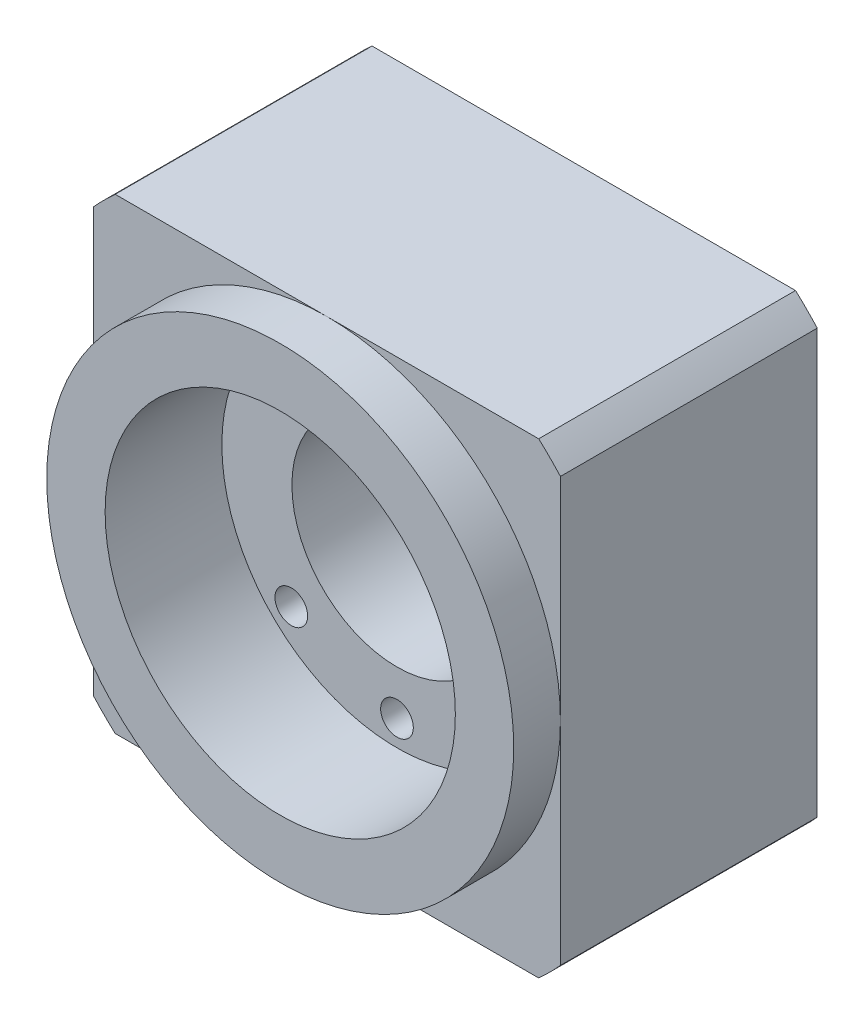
ISO-10303-21;
HEADER;
FILE_DESCRIPTION(('STEP AP214'),'2;1');
FILE_NAME('part.step','',(''),(''),'','','');
FILE_SCHEMA(('AUTOMOTIVE_DESIGN { 1 0 10303 214 1 1 1 1 }'));
ENDSEC;
DATA;
#1=APPLICATION_CONTEXT('core data for automotive mechanical design processes');
#2=APPLICATION_PROTOCOL_DEFINITION('international standard','automotive_design',2000,#1);
#3=PRODUCT_CONTEXT('',#1,'mechanical');
#4=PRODUCT('Part','Part','',(#3));
#5=PRODUCT_RELATED_PRODUCT_CATEGORY('part','',(#4));
#6=PRODUCT_DEFINITION_FORMATION('','',#4);
#7=PRODUCT_DEFINITION_CONTEXT('part definition',#1,'design');
#8=PRODUCT_DEFINITION('design','',#6,#7);
#9=PRODUCT_DEFINITION_SHAPE('','',#8);
#10=(LENGTH_UNIT() NAMED_UNIT(*) SI_UNIT(.MILLI.,.METRE.));
#11=(NAMED_UNIT(*) PLANE_ANGLE_UNIT() SI_UNIT($,.RADIAN.));
#12=(NAMED_UNIT(*) SI_UNIT($,.STERADIAN.) SOLID_ANGLE_UNIT());
#13=UNCERTAINTY_MEASURE_WITH_UNIT(LENGTH_MEASURE(1.E-05),#10,'distance_accuracy_value','');
#14=(GEOMETRIC_REPRESENTATION_CONTEXT(3) GLOBAL_UNCERTAINTY_ASSIGNED_CONTEXT((#13)) GLOBAL_UNIT_ASSIGNED_CONTEXT((#10,
#11,#12)) REPRESENTATION_CONTEXT('',''));
#15=CARTESIAN_POINT('',(0.,0.,0.));
#16=DIRECTION('',(0.,0.,1.));
#17=DIRECTION('',(1.,0.,0.));
#18=AXIS2_PLACEMENT_3D('',#15,#16,#17);
#19=CARTESIAN_POINT('',(22.0159155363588,21.5517258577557,40.));
#20=DIRECTION('',(0.,0.,-1.));
#21=DIRECTION('',(-1.,0.,0.));
#22=AXIS2_PLACEMENT_3D('',#19,#20,#21);
#23=PLANE('',#22);
#24=CARTESIAN_POINT('',(22.0159155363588,21.5517258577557,40.));
#25=DIRECTION('',(0.,0.,-1.));
#26=DIRECTION('',(-1.,0.,0.));
#27=AXIS2_PLACEMENT_3D('',#24,#25,#26);
#28=CIRCLE('',#27,22.5);
#29=CARTESIAN_POINT('',(-0.484084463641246,21.5517258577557,40.));
#30=VERTEX_POINT('',#29);
#31=EDGE_CURVE('E176',#30,#30,#28,.T.);
#32=ORIENTED_EDGE('',*,*,#31,.T.);
#33=EDGE_LOOP('',(#32));
#34=FACE_BOUND('',#33,.T.);
#35=CARTESIAN_POINT('',(22.0159155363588,-10.4482741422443,40.));
#36=DIRECTION('',(0.,0.,1.));
#37=DIRECTION('',(1.,0.,0.));
#38=AXIS2_PLACEMENT_3D('',#35,#36,#37);
#39=CIRCLE('',#38,3.5);
#40=CARTESIAN_POINT('',(25.5159155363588,-10.4482741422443,40.));
#41=VERTEX_POINT('',#40);
#42=EDGE_CURVE('E179',#41,#41,#39,.F.);
#43=ORIENTED_EDGE('',*,*,#42,.T.);
#44=EDGE_LOOP('',(#43));
#45=FACE_BOUND('',#44,.T.);
#46=CARTESIAN_POINT('',(44.6433325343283,-1.07569114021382,40.));
#47=DIRECTION('',(0.,0.,1.));
#48=DIRECTION('',(1.,0.,0.));
#49=AXIS2_PLACEMENT_3D('',#46,#47,#48);
#50=CIRCLE('',#49,3.50000000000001);
#51=CARTESIAN_POINT('',(48.1433325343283,-1.07569114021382,40.));
#52=VERTEX_POINT('',#51);
#53=EDGE_CURVE('E182',#52,#52,#50,.F.);
#54=ORIENTED_EDGE('',*,*,#53,.T.);
#55=EDGE_LOOP('',(#54));
#56=FACE_BOUND('',#55,.T.);
#57=CARTESIAN_POINT('',(-0.611501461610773,-1.07569114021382,40.));
#58=DIRECTION('',(0.,0.,1.));
#59=DIRECTION('',(1.,0.,0.));
#60=AXIS2_PLACEMENT_3D('',#57,#58,#59);
#61=CIRCLE('',#60,3.5);
#62=CARTESIAN_POINT('',(2.88849853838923,-1.07569114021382,40.));
#63=VERTEX_POINT('',#62);
#64=EDGE_CURVE('E185',#63,#63,#61,.F.);
#65=ORIENTED_EDGE('',*,*,#64,.T.);
#66=EDGE_LOOP('',(#65));
#67=FACE_BOUND('',#66,.T.);
#68=CARTESIAN_POINT('',(22.0159155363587,53.5517258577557,40.));
#69=DIRECTION('',(0.,0.,1.));
#70=DIRECTION('',(1.,0.,0.));
#71=AXIS2_PLACEMENT_3D('',#68,#69,#70);
#72=CIRCLE('',#71,3.5);
#73=CARTESIAN_POINT('',(25.5159155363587,53.5517258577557,40.));
#74=VERTEX_POINT('',#73);
#75=EDGE_CURVE('E188',#74,#74,#72,.F.);
#76=ORIENTED_EDGE('',*,*,#75,.T.);
#77=EDGE_LOOP('',(#76));
#78=FACE_BOUND('',#77,.T.);
#79=CARTESIAN_POINT('',(44.6433325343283,44.1791428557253,40.));
#80=DIRECTION('',(0.,0.,1.));
#81=DIRECTION('',(1.,0.,0.));
#82=AXIS2_PLACEMENT_3D('',#79,#80,#81);
#83=CIRCLE('',#82,3.5);
#84=CARTESIAN_POINT('',(48.1433325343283,44.1791428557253,40.));
#85=VERTEX_POINT('',#84);
#86=EDGE_CURVE('E191',#85,#85,#83,.F.);
#87=ORIENTED_EDGE('',*,*,#86,.T.);
#88=EDGE_LOOP('',(#87));
#89=FACE_BOUND('',#88,.T.);
#90=CARTESIAN_POINT('',(-0.611501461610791,44.1791428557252,40.));
#91=DIRECTION('',(0.,0.,1.));
#92=DIRECTION('',(1.,0.,0.));
#93=AXIS2_PLACEMENT_3D('',#90,#91,#92);
#94=CIRCLE('',#93,3.5);
#95=CARTESIAN_POINT('',(2.88849853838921,44.1791428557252,40.));
#96=VERTEX_POINT('',#95);
#97=EDGE_CURVE('E193',#96,#96,#94,.F.);
#98=ORIENTED_EDGE('',*,*,#97,.T.);
#99=EDGE_LOOP('',(#98));
#100=FACE_BOUND('',#99,.T.);
#101=CARTESIAN_POINT('',(22.0159155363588,21.5517258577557,40.));
#102=DIRECTION('',(0.,0.,-1.));
#103=DIRECTION('',(-1.,0.,0.));
#104=AXIS2_PLACEMENT_3D('',#101,#102,#103);
#105=CIRCLE('',#104,37.5);
#106=CARTESIAN_POINT('',(-15.4840844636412,21.5517258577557,40.));
#107=VERTEX_POINT('',#106);
#108=EDGE_CURVE('E20',#107,#107,#105,.F.);
#109=ORIENTED_EDGE('',*,*,#108,.T.);
#110=EDGE_LOOP('',(#109));
#111=FACE_BOUND('',#110,.T.);
#112=ADVANCED_FACE('F16',(#34,#45,#56,#67,#78,#89,#100,#111),#23,.F.);
#113=CARTESIAN_POINT('',(22.0159155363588,21.5517258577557,65.));
#114=DIRECTION('',(0.,0.,-1.));
#115=DIRECTION('',(-1.,0.,0.));
#116=AXIS2_PLACEMENT_3D('',#113,#114,#115);
#117=CYLINDRICAL_SURFACE('',#116,37.5);
#118=CARTESIAN_POINT('',(22.0159155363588,21.5517258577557,65.));
#119=DIRECTION('',(0.,0.,-1.));
#120=DIRECTION('',(-1.,0.,0.));
#121=AXIS2_PLACEMENT_3D('',#118,#119,#120);
#122=CIRCLE('',#121,37.5);
#123=CARTESIAN_POINT('',(-15.4840844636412,21.5517258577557,65.));
#124=VERTEX_POINT('',#123);
#125=EDGE_CURVE('E103',#124,#124,#122,.F.);
#126=ORIENTED_EDGE('',*,*,#125,.T.);
#127=EDGE_LOOP('',(#126));
#128=FACE_BOUND('',#127,.T.);
#129=ORIENTED_EDGE('',*,*,#108,.F.);
#130=EDGE_LOOP('',(#129));
#131=FACE_BOUND('',#130,.T.);
#132=ADVANCED_FACE('F201',(#128,#131),#117,.F.);
#133=CARTESIAN_POINT('',(-0.611501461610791,44.1791428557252,170.643824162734));
#134=DIRECTION('',(0.,0.,1.));
#135=DIRECTION('',(1.,0.,0.));
#136=AXIS2_PLACEMENT_3D('',#133,#134,#135);
#137=CYLINDRICAL_SURFACE('',#136,3.5);
#138=ORIENTED_EDGE('',*,*,#97,.F.);
#139=EDGE_LOOP('',(#138));
#140=FACE_BOUND('',#139,.T.);
#141=CARTESIAN_POINT('',(-0.611501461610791,44.1791428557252,15.));
#142=DIRECTION('',(0.,0.,1.));
#143=DIRECTION('',(1.,0.,0.));
#144=AXIS2_PLACEMENT_3D('',#141,#142,#143);
#145=CIRCLE('',#144,3.5);
#146=CARTESIAN_POINT('',(2.88849853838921,44.1791428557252,15.));
#147=VERTEX_POINT('',#146);
#148=EDGE_CURVE('E102',#147,#147,#145,.F.);
#149=ORIENTED_EDGE('',*,*,#148,.T.);
#150=EDGE_LOOP('',(#149));
#151=FACE_BOUND('',#150,.T.);
#152=ADVANCED_FACE('F203',(#140,#151),#137,.F.);
#153=CARTESIAN_POINT('',(44.6433325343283,44.1791428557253,170.643824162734));
#154=DIRECTION('',(0.,0.,1.));
#155=DIRECTION('',(1.,0.,0.));
#156=AXIS2_PLACEMENT_3D('',#153,#154,#155);
#157=CYLINDRICAL_SURFACE('',#156,3.5);
#158=ORIENTED_EDGE('',*,*,#86,.F.);
#159=EDGE_LOOP('',(#158));
#160=FACE_BOUND('',#159,.T.);
#161=CARTESIAN_POINT('',(44.6433325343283,44.1791428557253,15.));
#162=DIRECTION('',(0.,0.,1.));
#163=DIRECTION('',(1.,0.,0.));
#164=AXIS2_PLACEMENT_3D('',#161,#162,#163);
#165=CIRCLE('',#164,3.5);
#166=CARTESIAN_POINT('',(48.1433325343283,44.1791428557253,15.));
#167=VERTEX_POINT('',#166);
#168=EDGE_CURVE('E169',#167,#167,#165,.F.);
#169=ORIENTED_EDGE('',*,*,#168,.T.);
#170=EDGE_LOOP('',(#169));
#171=FACE_BOUND('',#170,.T.);
#172=ADVANCED_FACE('F209',(#160,#171),#157,.F.);
#173=CARTESIAN_POINT('',(22.0159155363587,53.5517258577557,170.643824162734));
#174=DIRECTION('',(0.,0.,1.));
#175=DIRECTION('',(1.,0.,0.));
#176=AXIS2_PLACEMENT_3D('',#173,#174,#175);
#177=CYLINDRICAL_SURFACE('',#176,3.5);
#178=ORIENTED_EDGE('',*,*,#75,.F.);
#179=EDGE_LOOP('',(#178));
#180=FACE_BOUND('',#179,.T.);
#181=CARTESIAN_POINT('',(22.0159155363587,53.5517258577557,15.));
#182=DIRECTION('',(0.,0.,1.));
#183=DIRECTION('',(1.,0.,0.));
#184=AXIS2_PLACEMENT_3D('',#181,#182,#183);
#185=CIRCLE('',#184,3.5);
#186=CARTESIAN_POINT('',(25.5159155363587,53.5517258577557,15.));
#187=VERTEX_POINT('',#186);
#188=EDGE_CURVE('E166',#187,#187,#185,.F.);
#189=ORIENTED_EDGE('',*,*,#188,.T.);
#190=EDGE_LOOP('',(#189));
#191=FACE_BOUND('',#190,.T.);
#192=ADVANCED_FACE('F231',(#180,#191),#177,.F.);
#193=CARTESIAN_POINT('',(-0.611501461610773,-1.07569114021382,15.));
#194=DIRECTION('',(0.,0.,1.));
#195=DIRECTION('',(1.,0.,0.));
#196=AXIS2_PLACEMENT_3D('',#193,#194,#195);
#197=CYLINDRICAL_SURFACE('',#196,3.5);
#198=ORIENTED_EDGE('',*,*,#64,.F.);
#199=EDGE_LOOP('',(#198));
#200=FACE_BOUND('',#199,.T.);
#201=CARTESIAN_POINT('',(-0.611501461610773,-1.07569114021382,15.));
#202=DIRECTION('',(0.,0.,1.));
#203=DIRECTION('',(1.,0.,0.));
#204=AXIS2_PLACEMENT_3D('',#201,#202,#203);
#205=CIRCLE('',#204,3.5);
#206=CARTESIAN_POINT('',(2.88849853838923,-1.07569114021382,15.));
#207=VERTEX_POINT('',#206);
#208=EDGE_CURVE('E163',#207,#207,#205,.F.);
#209=ORIENTED_EDGE('',*,*,#208,.T.);
#210=EDGE_LOOP('',(#209));
#211=FACE_BOUND('',#210,.T.);
#212=ADVANCED_FACE('F228',(#200,#211),#197,.F.);
#213=CARTESIAN_POINT('',(44.6433325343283,-1.07569114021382,15.));
#214=DIRECTION('',(0.,0.,1.));
#215=DIRECTION('',(1.,0.,0.));
#216=AXIS2_PLACEMENT_3D('',#213,#214,#215);
#217=CYLINDRICAL_SURFACE('',#216,3.50000000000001);
#218=ORIENTED_EDGE('',*,*,#53,.F.);
#219=EDGE_LOOP('',(#218));
#220=FACE_BOUND('',#219,.T.);
#221=CARTESIAN_POINT('',(44.6433325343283,-1.07569114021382,15.));
#222=DIRECTION('',(0.,0.,1.));
#223=DIRECTION('',(1.,0.,0.));
#224=AXIS2_PLACEMENT_3D('',#221,#222,#223);
#225=CIRCLE('',#224,3.50000000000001);
#226=CARTESIAN_POINT('',(48.1433325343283,-1.07569114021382,15.));
#227=VERTEX_POINT('',#226);
#228=EDGE_CURVE('E160',#227,#227,#225,.F.);
#229=ORIENTED_EDGE('',*,*,#228,.T.);
#230=EDGE_LOOP('',(#229));
#231=FACE_BOUND('',#230,.T.);
#232=ADVANCED_FACE('F230',(#220,#231),#217,.F.);
#233=CARTESIAN_POINT('',(22.0159155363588,-10.4482741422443,15.));
#234=DIRECTION('',(0.,0.,1.));
#235=DIRECTION('',(1.,0.,0.));
#236=AXIS2_PLACEMENT_3D('',#233,#234,#235);
#237=CYLINDRICAL_SURFACE('',#236,3.5);
#238=ORIENTED_EDGE('',*,*,#42,.F.);
#239=EDGE_LOOP('',(#238));
#240=FACE_BOUND('',#239,.T.);
#241=CARTESIAN_POINT('',(22.0159155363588,-10.4482741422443,15.));
#242=DIRECTION('',(0.,0.,1.));
#243=DIRECTION('',(1.,0.,0.));
#244=AXIS2_PLACEMENT_3D('',#241,#242,#243);
#245=CIRCLE('',#244,3.5);
#246=CARTESIAN_POINT('',(25.5159155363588,-10.4482741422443,15.));
#247=VERTEX_POINT('',#246);
#248=EDGE_CURVE('E157',#247,#247,#245,.F.);
#249=ORIENTED_EDGE('',*,*,#248,.T.);
#250=EDGE_LOOP('',(#249));
#251=FACE_BOUND('',#250,.T.);
#252=ADVANCED_FACE('F18',(#240,#251),#237,.F.);
#253=CARTESIAN_POINT('',(22.0159155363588,21.5517258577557,40.));
#254=DIRECTION('',(0.,0.,-1.));
#255=DIRECTION('',(-1.,0.,0.));
#256=AXIS2_PLACEMENT_3D('',#253,#254,#255);
#257=CYLINDRICAL_SURFACE('',#256,22.5);
#258=CARTESIAN_POINT('',(22.0159155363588,21.5517258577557,15.));
#259=DIRECTION('',(0.,0.,-1.));
#260=DIRECTION('',(-1.,0.,0.));
#261=AXIS2_PLACEMENT_3D('',#258,#259,#260);
#262=CIRCLE('',#261,22.5);
#263=CARTESIAN_POINT('',(-0.484084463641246,21.5517258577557,15.));
#264=VERTEX_POINT('',#263);
#265=EDGE_CURVE('E154',#264,#264,#262,.T.);
#266=ORIENTED_EDGE('',*,*,#265,.T.);
#267=EDGE_LOOP('',(#266));
#268=FACE_BOUND('',#267,.T.);
#269=ORIENTED_EDGE('',*,*,#31,.F.);
#270=EDGE_LOOP('',(#269));
#271=FACE_BOUND('',#270,.T.);
#272=ADVANCED_FACE('F237',(#268,#271),#257,.F.);
#273=CARTESIAN_POINT('',(22.0159155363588,21.5517258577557,65.));
#274=DIRECTION('',(0.,0.,-1.));
#275=DIRECTION('',(-1.,0.,0.));
#276=AXIS2_PLACEMENT_3D('',#273,#274,#275);
#277=PLANE('',#276);
#278=ORIENTED_EDGE('',*,*,#125,.F.);
#279=EDGE_LOOP('',(#278));
#280=FACE_BOUND('',#279,.T.);
#281=CARTESIAN_POINT('',(22.0159155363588,21.5517258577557,65.));
#282=DIRECTION('',(0.,0.,1.));
#283=DIRECTION('',(1.,0.,0.));
#284=AXIS2_PLACEMENT_3D('',#281,#282,#283);
#285=CIRCLE('',#284,50.);
#286=CARTESIAN_POINT('',(72.0159155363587,21.5517258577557,65.));
#287=VERTEX_POINT('',#286);
#288=EDGE_CURVE('E114',#287,#287,#285,.F.);
#289=ORIENTED_EDGE('',*,*,#288,.F.);
#290=EDGE_LOOP('',(#289));
#291=FACE_BOUND('',#290,.T.);
#292=ADVANCED_FACE('F360',(#280,#291),#277,.F.);
#293=CARTESIAN_POINT('',(22.0159155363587,21.5517258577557,55.));
#294=DIRECTION('',(0.,0.,1.));
#295=DIRECTION('',(1.,0.,0.));
#296=AXIS2_PLACEMENT_3D('',#293,#294,#295);
#297=PLANE('',#296);
#298=CARTESIAN_POINT('',(22.0159155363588,21.5517258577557,55.));
#299=DIRECTION('',(0.,0.,1.));
#300=DIRECTION('',(1.,0.,0.));
#301=AXIS2_PLACEMENT_3D('',#298,#299,#300);
#302=CIRCLE('',#301,67.5);
#303=CARTESIAN_POINT('',(-27.9840844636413,66.8976187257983,55.));
#304=VERTEX_POINT('',#303);
#305=CARTESIAN_POINT('',(-23.3299773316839,71.5517258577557,55.));
#306=VERTEX_POINT('',#305);
#307=EDGE_CURVE('E110',#304,#306,#302,.F.);
#308=ORIENTED_EDGE('',*,*,#307,.F.);
#309=DIRECTION('',(0.,1.,0.));
#310=VECTOR('',#309,1.);
#311=CARTESIAN_POINT('',(-27.9840844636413,-23.7941670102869,55.));
#312=LINE('',#311,#310);
#313=CARTESIAN_POINT('',(-27.9840844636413,21.5517258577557,55.));
#314=VERTEX_POINT('',#313);
#315=EDGE_CURVE('E106',#314,#304,#312,.T.);
#316=ORIENTED_EDGE('',*,*,#315,.F.);
#317=CARTESIAN_POINT('',(22.0159155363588,21.5517258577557,55.));
#318=DIRECTION('',(0.,0.,1.));
#319=DIRECTION('',(1.,0.,0.));
#320=AXIS2_PLACEMENT_3D('',#317,#318,#319);
#321=CIRCLE('',#320,50.);
#322=CARTESIAN_POINT('',(22.0159155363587,71.5517258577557,55.));
#323=VERTEX_POINT('',#322);
#324=EDGE_CURVE('E91',#314,#323,#321,.F.);
#325=ORIENTED_EDGE('',*,*,#324,.T.);
#326=DIRECTION('',(1.,0.,0.));
#327=VECTOR('',#326,1.);
#328=CARTESIAN_POINT('',(-23.3299773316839,71.5517258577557,55.));
#329=LINE('',#328,#327);
#330=EDGE_CURVE('E150',#306,#323,#329,.T.);
#331=ORIENTED_EDGE('',*,*,#330,.F.);
#332=EDGE_LOOP('',(#308,#316,#325,#331));
#333=FACE_BOUND('',#332,.T.);
#334=ADVANCED_FACE('F108',(#333),#297,.T.);
#335=CARTESIAN_POINT('',(22.0159155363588,21.5517258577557,15.));
#336=DIRECTION('',(0.,0.,1.));
#337=DIRECTION('',(1.,0.,0.));
#338=AXIS2_PLACEMENT_3D('',#335,#336,#337);
#339=PLANE('',#338);
#340=ORIENTED_EDGE('',*,*,#265,.F.);
#341=EDGE_LOOP('',(#340));
#342=FACE_BOUND('',#341,.T.);
#343=ORIENTED_EDGE('',*,*,#248,.F.);
#344=EDGE_LOOP('',(#343));
#345=FACE_BOUND('',#344,.T.);
#346=ORIENTED_EDGE('',*,*,#228,.F.);
#347=EDGE_LOOP('',(#346));
#348=FACE_BOUND('',#347,.T.);
#349=ORIENTED_EDGE('',*,*,#208,.F.);
#350=EDGE_LOOP('',(#349));
#351=FACE_BOUND('',#350,.T.);
#352=ORIENTED_EDGE('',*,*,#188,.F.);
#353=EDGE_LOOP('',(#352));
#354=FACE_BOUND('',#353,.T.);
#355=ORIENTED_EDGE('',*,*,#168,.F.);
#356=EDGE_LOOP('',(#355));
#357=FACE_BOUND('',#356,.T.);
#358=ORIENTED_EDGE('',*,*,#148,.F.);
#359=EDGE_LOOP('',(#358));
#360=FACE_BOUND('',#359,.T.);
#361=CARTESIAN_POINT('',(22.0159155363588,21.5517258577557,15.));
#362=DIRECTION('',(0.,0.,1.));
#363=DIRECTION('',(1.,0.,0.));
#364=AXIS2_PLACEMENT_3D('',#361,#362,#363);
#365=CIRCLE('',#364,45.);
#366=CARTESIAN_POINT('',(67.0159155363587,21.5517258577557,15.));
#367=VERTEX_POINT('',#366);
#368=EDGE_CURVE('E140',#367,#367,#365,.F.);
#369=ORIENTED_EDGE('',*,*,#368,.T.);
#370=EDGE_LOOP('',(#369));
#371=FACE_BOUND('',#370,.T.);
#372=ADVANCED_FACE('F243',(#342,#345,#348,#351,#354,#357,#360,#371),#339,.F.);
#373=CARTESIAN_POINT('',(22.0159155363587,21.5517258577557,55.));
#374=DIRECTION('',(0.,0.,1.));
#375=DIRECTION('',(1.,0.,0.));
#376=AXIS2_PLACEMENT_3D('',#373,#374,#375);
#377=PLANE('',#376);
#378=CARTESIAN_POINT('',(22.0159155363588,21.5517258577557,55.));
#379=DIRECTION('',(0.,0.,1.));
#380=DIRECTION('',(1.,0.,0.));
#381=AXIS2_PLACEMENT_3D('',#378,#379,#380);
#382=CIRCLE('',#381,67.5);
#383=CARTESIAN_POINT('',(67.3618084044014,71.5517258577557,55.));
#384=VERTEX_POINT('',#383);
#385=CARTESIAN_POINT('',(72.0159155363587,66.8976187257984,55.));
#386=VERTEX_POINT('',#385);
#387=EDGE_CURVE('E113',#384,#386,#382,.F.);
#388=ORIENTED_EDGE('',*,*,#387,.F.);
#389=DIRECTION('',(1.,0.,0.));
#390=VECTOR('',#389,1.);
#391=CARTESIAN_POINT('',(-23.3299773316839,71.5517258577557,55.));
#392=LINE('',#391,#390);
#393=EDGE_CURVE('E326',#323,#384,#392,.T.);
#394=ORIENTED_EDGE('',*,*,#393,.F.);
#395=CARTESIAN_POINT('',(22.0159155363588,21.5517258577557,55.));
#396=DIRECTION('',(0.,0.,1.));
#397=DIRECTION('',(1.,0.,0.));
#398=AXIS2_PLACEMENT_3D('',#395,#396,#397);
#399=CIRCLE('',#398,50.);
#400=CARTESIAN_POINT('',(72.0159155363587,21.5517258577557,55.));
#401=VERTEX_POINT('',#400);
#402=EDGE_CURVE('E99',#323,#401,#399,.F.);
#403=ORIENTED_EDGE('',*,*,#402,.T.);
#404=DIRECTION('',(0.,1.,0.));
#405=VECTOR('',#404,1.);
#406=CARTESIAN_POINT('',(72.0159155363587,66.8976187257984,55.));
#407=LINE('',#406,#405);
#408=EDGE_CURVE('E143',#386,#401,#407,.F.);
#409=ORIENTED_EDGE('',*,*,#408,.F.);
#410=EDGE_LOOP('',(#388,#394,#403,#409));
#411=FACE_BOUND('',#410,.T.);
#412=ADVANCED_FACE('F246',(#411),#377,.T.);
#413=CARTESIAN_POINT('',(22.0159155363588,21.5517258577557,55.));
#414=DIRECTION('',(0.,0.,1.));
#415=DIRECTION('',(1.,0.,0.));
#416=AXIS2_PLACEMENT_3D('',#413,#414,#415);
#417=CYLINDRICAL_SURFACE('',#416,50.);
#418=ORIENTED_EDGE('',*,*,#324,.F.);
#419=CARTESIAN_POINT('',(22.0159155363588,21.5517258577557,55.));
#420=DIRECTION('',(0.,0.,1.));
#421=DIRECTION('',(1.,0.,0.));
#422=AXIS2_PLACEMENT_3D('',#419,#420,#421);
#423=CIRCLE('',#422,50.);
#424=CARTESIAN_POINT('',(22.0159155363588,-28.4482741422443,55.));
#425=VERTEX_POINT('',#424);
#426=EDGE_CURVE('E97',#425,#314,#423,.F.);
#427=ORIENTED_EDGE('',*,*,#426,.F.);
#428=CARTESIAN_POINT('',(22.0159155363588,21.5517258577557,55.));
#429=DIRECTION('',(0.,0.,1.));
#430=DIRECTION('',(1.,0.,0.));
#431=AXIS2_PLACEMENT_3D('',#428,#429,#430);
#432=CIRCLE('',#431,50.);
#433=EDGE_CURVE('E133',#401,#425,#432,.F.);
#434=ORIENTED_EDGE('',*,*,#433,.F.);
#435=ORIENTED_EDGE('',*,*,#402,.F.);
#436=EDGE_LOOP('',(#418,#427,#434,#435));
#437=FACE_BOUND('',#436,.T.);
#438=ORIENTED_EDGE('',*,*,#288,.T.);
#439=EDGE_LOOP('',(#438));
#440=FACE_BOUND('',#439,.T.);
#441=ADVANCED_FACE('F93',(#437,#440),#417,.T.);
#442=CARTESIAN_POINT('',(-27.9840844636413,-23.7941670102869,0.));
#443=DIRECTION('',(-1.,0.,0.));
#444=DIRECTION('',(0.,0.,1.));
#445=AXIS2_PLACEMENT_3D('',#442,#443,#444);
#446=PLANE('',#445);
#447=DIRECTION('',(0.,1.,0.));
#448=VECTOR('',#447,1.);
#449=CARTESIAN_POINT('',(-27.9840844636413,21.5517258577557,0.));
#450=LINE('',#449,#448);
#451=CARTESIAN_POINT('',(-27.9840844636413,66.8976187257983,0.));
#452=VERTEX_POINT('',#451);
#453=CARTESIAN_POINT('',(-27.9840844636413,-23.7941670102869,0.));
#454=VERTEX_POINT('',#453);
#455=EDGE_CURVE('E311',#452,#454,#450,.F.);
#456=ORIENTED_EDGE('',*,*,#455,.T.);
#457=DIRECTION('',(0.,0.,1.));
#458=VECTOR('',#457,1.);
#459=CARTESIAN_POINT('',(-27.9840844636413,-23.7941670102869,0.));
#460=LINE('',#459,#458);
#461=CARTESIAN_POINT('',(-27.9840844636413,-23.7941670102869,55.));
#462=VERTEX_POINT('',#461);
#463=EDGE_CURVE('E120',#462,#454,#460,.F.);
#464=ORIENTED_EDGE('',*,*,#463,.F.);
#465=DIRECTION('',(0.,1.,0.));
#466=VECTOR('',#465,1.);
#467=CARTESIAN_POINT('',(-27.9840844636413,21.5517258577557,55.));
#468=LINE('',#467,#466);
#469=EDGE_CURVE('E117',#314,#462,#468,.F.);
#470=ORIENTED_EDGE('',*,*,#469,.F.);
#471=ORIENTED_EDGE('',*,*,#315,.T.);
#472=DIRECTION('',(0.,0.,1.));
#473=VECTOR('',#472,1.);
#474=CARTESIAN_POINT('',(-27.9840844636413,66.8976187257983,0.));
#475=LINE('',#474,#473);
#476=EDGE_CURVE('E144',#452,#304,#475,.T.);
#477=ORIENTED_EDGE('',*,*,#476,.F.);
#478=EDGE_LOOP('',(#456,#464,#470,#471,#477));
#479=FACE_BOUND('',#478,.T.);
#480=ADVANCED_FACE('F118',(#479),#446,.T.);
#481=CARTESIAN_POINT('',(22.0159155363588,21.5517258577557,0.));
#482=DIRECTION('',(0.,0.,1.));
#483=DIRECTION('',(1.,0.,0.));
#484=AXIS2_PLACEMENT_3D('',#481,#482,#483);
#485=CYLINDRICAL_SURFACE('',#484,67.5);
#486=CARTESIAN_POINT('',(22.0159155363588,21.5517258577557,0.));
#487=DIRECTION('',(0.,0.,1.));
#488=DIRECTION('',(1.,0.,0.));
#489=AXIS2_PLACEMENT_3D('',#486,#487,#488);
#490=CIRCLE('',#489,67.5);
#491=CARTESIAN_POINT('',(72.0159155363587,66.8976187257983,0.));
#492=VERTEX_POINT('',#491);
#493=CARTESIAN_POINT('',(67.3618084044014,71.5517258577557,0.));
#494=VERTEX_POINT('',#493);
#495=EDGE_CURVE('E295',#492,#494,#490,.T.);
#496=ORIENTED_EDGE('',*,*,#495,.T.);
#497=DIRECTION('',(0.,0.,1.));
#498=VECTOR('',#497,1.);
#499=CARTESIAN_POINT('',(67.3618084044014,71.5517258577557,0.));
#500=LINE('',#499,#498);
#501=EDGE_CURVE('E147',#384,#494,#500,.F.);
#502=ORIENTED_EDGE('',*,*,#501,.F.);
#503=ORIENTED_EDGE('',*,*,#387,.T.);
#504=DIRECTION('',(0.,0.,-1.));
#505=VECTOR('',#504,1.);
#506=CARTESIAN_POINT('',(72.0159155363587,66.8976187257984,0.));
#507=LINE('',#506,#505);
#508=EDGE_CURVE('E139',#492,#386,#507,.F.);
#509=ORIENTED_EDGE('',*,*,#508,.F.);
#510=EDGE_LOOP('',(#496,#502,#503,#509));
#511=FACE_BOUND('',#510,.T.);
#512=ADVANCED_FACE('F347',(#511),#485,.T.);
#513=CARTESIAN_POINT('',(-23.3299773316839,71.5517258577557,0.));
#514=DIRECTION('',(0.,1.,0.));
#515=DIRECTION('',(0.,0.,1.));
#516=AXIS2_PLACEMENT_3D('',#513,#514,#515);
#517=PLANE('',#516);
#518=DIRECTION('',(1.,0.,0.));
#519=VECTOR('',#518,1.);
#520=CARTESIAN_POINT('',(22.0159155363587,71.5517258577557,0.));
#521=LINE('',#520,#519);
#522=CARTESIAN_POINT('',(-23.3299773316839,71.5517258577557,0.));
#523=VERTEX_POINT('',#522);
#524=EDGE_CURVE('E294',#494,#523,#521,.F.);
#525=ORIENTED_EDGE('',*,*,#524,.T.);
#526=DIRECTION('',(0.,0.,1.));
#527=VECTOR('',#526,1.);
#528=CARTESIAN_POINT('',(-23.3299773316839,71.5517258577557,0.));
#529=LINE('',#528,#527);
#530=EDGE_CURVE('E146',#306,#523,#529,.F.);
#531=ORIENTED_EDGE('',*,*,#530,.F.);
#532=ORIENTED_EDGE('',*,*,#330,.T.);
#533=ORIENTED_EDGE('',*,*,#393,.T.);
#534=ORIENTED_EDGE('',*,*,#501,.T.);
#535=EDGE_LOOP('',(#525,#531,#532,#533,#534));
#536=FACE_BOUND('',#535,.T.);
#537=ADVANCED_FACE('F271',(#536),#517,.T.);
#538=CARTESIAN_POINT('',(22.0159155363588,21.5517258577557,0.));
#539=DIRECTION('',(0.,0.,1.));
#540=DIRECTION('',(1.,0.,0.));
#541=AXIS2_PLACEMENT_3D('',#538,#539,#540);
#542=CYLINDRICAL_SURFACE('',#541,67.5);
#543=CARTESIAN_POINT('',(22.0159155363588,21.5517258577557,0.));
#544=DIRECTION('',(0.,0.,1.));
#545=DIRECTION('',(1.,0.,0.));
#546=AXIS2_PLACEMENT_3D('',#543,#544,#545);
#547=CIRCLE('',#546,67.5);
#548=EDGE_CURVE('E298',#523,#452,#547,.T.);
#549=ORIENTED_EDGE('',*,*,#548,.T.);
#550=ORIENTED_EDGE('',*,*,#476,.T.);
#551=ORIENTED_EDGE('',*,*,#307,.T.);
#552=ORIENTED_EDGE('',*,*,#530,.T.);
#553=EDGE_LOOP('',(#549,#550,#551,#552));
#554=FACE_BOUND('',#553,.T.);
#555=ADVANCED_FACE('F262',(#554),#542,.T.);
#556=CARTESIAN_POINT('',(22.0159155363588,21.5517258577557,0.));
#557=DIRECTION('',(0.,0.,1.));
#558=DIRECTION('',(1.,0.,0.));
#559=AXIS2_PLACEMENT_3D('',#556,#557,#558);
#560=CYLINDRICAL_SURFACE('',#559,45.);
#561=CARTESIAN_POINT('',(22.0159155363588,21.5517258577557,0.));
#562=DIRECTION('',(0.,0.,1.));
#563=DIRECTION('',(1.,0.,0.));
#564=AXIS2_PLACEMENT_3D('',#561,#562,#563);
#565=CIRCLE('',#564,45.);
#566=CARTESIAN_POINT('',(67.0159155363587,21.5517258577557,0.));
#567=VERTEX_POINT('',#566);
#568=EDGE_CURVE('E290',#567,#567,#565,.F.);
#569=ORIENTED_EDGE('',*,*,#568,.T.);
#570=EDGE_LOOP('',(#569));
#571=FACE_BOUND('',#570,.T.);
#572=ORIENTED_EDGE('',*,*,#368,.F.);
#573=EDGE_LOOP('',(#572));
#574=FACE_BOUND('',#573,.T.);
#575=ADVANCED_FACE('F259',(#571,#574),#560,.F.);
#576=CARTESIAN_POINT('',(72.0159155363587,66.8976187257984,0.));
#577=DIRECTION('',(1.,0.,0.));
#578=DIRECTION('',(0.,0.,-1.));
#579=AXIS2_PLACEMENT_3D('',#576,#577,#578);
#580=PLANE('',#579);
#581=DIRECTION('',(0.,1.,0.));
#582=VECTOR('',#581,1.);
#583=CARTESIAN_POINT('',(72.0159155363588,21.5517258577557,0.));
#584=LINE('',#583,#582);
#585=CARTESIAN_POINT('',(72.0159155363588,-23.7941670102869,0.));
#586=VERTEX_POINT('',#585);
#587=EDGE_CURVE('E305',#586,#492,#584,.T.);
#588=ORIENTED_EDGE('',*,*,#587,.T.);
#589=ORIENTED_EDGE('',*,*,#508,.T.);
#590=ORIENTED_EDGE('',*,*,#408,.T.);
#591=DIRECTION('',(0.,1.,0.));
#592=VECTOR('',#591,1.);
#593=CARTESIAN_POINT('',(72.0159155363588,21.5517258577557,55.));
#594=LINE('',#593,#592);
#595=CARTESIAN_POINT('',(72.0159155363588,-23.7941670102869,55.));
#596=VERTEX_POINT('',#595);
#597=EDGE_CURVE('E130',#596,#401,#594,.T.);
#598=ORIENTED_EDGE('',*,*,#597,.F.);
#599=DIRECTION('',(0.,0.,1.));
#600=VECTOR('',#599,1.);
#601=CARTESIAN_POINT('',(72.0159155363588,-23.7941670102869,0.));
#602=LINE('',#601,#600);
#603=EDGE_CURVE('E320',#586,#596,#602,.T.);
#604=ORIENTED_EDGE('',*,*,#603,.F.);
#605=EDGE_LOOP('',(#588,#589,#590,#598,#604));
#606=FACE_BOUND('',#605,.T.);
#607=ADVANCED_FACE('F261',(#606),#580,.T.);
#608=CARTESIAN_POINT('',(22.0159155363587,21.5517258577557,55.));
#609=DIRECTION('',(0.,0.,1.));
#610=DIRECTION('',(1.,0.,0.));
#611=AXIS2_PLACEMENT_3D('',#608,#609,#610);
#612=PLANE('',#611);
#613=CARTESIAN_POINT('',(22.0159155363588,21.5517258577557,55.));
#614=DIRECTION('',(0.,0.,1.));
#615=DIRECTION('',(1.,0.,0.));
#616=AXIS2_PLACEMENT_3D('',#613,#614,#615);
#617=CIRCLE('',#616,67.5);
#618=CARTESIAN_POINT('',(67.3618084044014,-28.4482741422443,55.));
#619=VERTEX_POINT('',#618);
#620=EDGE_CURVE('E337',#596,#619,#617,.F.);
#621=ORIENTED_EDGE('',*,*,#620,.F.);
#622=ORIENTED_EDGE('',*,*,#597,.T.);
#623=ORIENTED_EDGE('',*,*,#433,.T.);
#624=DIRECTION('',(1.,0.,0.));
#625=VECTOR('',#624,1.);
#626=CARTESIAN_POINT('',(67.3618084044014,-28.4482741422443,55.));
#627=LINE('',#626,#625);
#628=EDGE_CURVE('E318',#619,#425,#627,.F.);
#629=ORIENTED_EDGE('',*,*,#628,.F.);
#630=EDGE_LOOP('',(#621,#622,#623,#629));
#631=FACE_BOUND('',#630,.T.);
#632=ADVANCED_FACE('F267',(#631),#612,.T.);
#633=CARTESIAN_POINT('',(22.0159155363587,21.5517258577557,55.));
#634=DIRECTION('',(0.,0.,1.));
#635=DIRECTION('',(1.,0.,0.));
#636=AXIS2_PLACEMENT_3D('',#633,#634,#635);
#637=PLANE('',#636);
#638=CARTESIAN_POINT('',(22.0159155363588,21.5517258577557,55.));
#639=DIRECTION('',(0.,0.,1.));
#640=DIRECTION('',(1.,0.,0.));
#641=AXIS2_PLACEMENT_3D('',#638,#639,#640);
#642=CIRCLE('',#641,67.5);
#643=CARTESIAN_POINT('',(-23.3299773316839,-28.4482741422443,55.));
#644=VERTEX_POINT('',#643);
#645=EDGE_CURVE('E123',#644,#462,#642,.F.);
#646=ORIENTED_EDGE('',*,*,#645,.F.);
#647=DIRECTION('',(1.,0.,0.));
#648=VECTOR('',#647,1.);
#649=CARTESIAN_POINT('',(67.3618084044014,-28.4482741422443,55.));
#650=LINE('',#649,#648);
#651=EDGE_CURVE('E128',#425,#644,#650,.F.);
#652=ORIENTED_EDGE('',*,*,#651,.F.);
#653=ORIENTED_EDGE('',*,*,#426,.T.);
#654=ORIENTED_EDGE('',*,*,#469,.T.);
#655=EDGE_LOOP('',(#646,#652,#653,#654));
#656=FACE_BOUND('',#655,.T.);
#657=ADVANCED_FACE('F126',(#656),#637,.T.);
#658=CARTESIAN_POINT('',(22.0159155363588,21.5517258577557,0.));
#659=DIRECTION('',(0.,0.,1.));
#660=DIRECTION('',(1.,0.,0.));
#661=AXIS2_PLACEMENT_3D('',#658,#659,#660);
#662=CYLINDRICAL_SURFACE('',#661,67.5);
#663=CARTESIAN_POINT('',(22.0159155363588,21.5517258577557,0.));
#664=DIRECTION('',(0.,0.,1.));
#665=DIRECTION('',(1.,0.,0.));
#666=AXIS2_PLACEMENT_3D('',#663,#664,#665);
#667=CIRCLE('',#666,67.5);
#668=CARTESIAN_POINT('',(-23.3299773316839,-28.4482741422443,0.));
#669=VERTEX_POINT('',#668);
#670=EDGE_CURVE('E310',#454,#669,#667,.T.);
#671=ORIENTED_EDGE('',*,*,#670,.T.);
#672=DIRECTION('',(0.,0.,-1.));
#673=VECTOR('',#672,1.);
#674=CARTESIAN_POINT('',(-23.3299773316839,-28.4482741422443,0.));
#675=LINE('',#674,#673);
#676=EDGE_CURVE('E313',#644,#669,#675,.T.);
#677=ORIENTED_EDGE('',*,*,#676,.F.);
#678=ORIENTED_EDGE('',*,*,#645,.T.);
#679=ORIENTED_EDGE('',*,*,#463,.T.);
#680=EDGE_LOOP('',(#671,#677,#678,#679));
#681=FACE_BOUND('',#680,.T.);
#682=ADVANCED_FACE('F282',(#681),#662,.T.);
#683=CARTESIAN_POINT('',(22.0159155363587,21.5517258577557,0.));
#684=DIRECTION('',(0.,0.,1.));
#685=DIRECTION('',(1.,0.,0.));
#686=AXIS2_PLACEMENT_3D('',#683,#684,#685);
#687=PLANE('',#686);
#688=ORIENTED_EDGE('',*,*,#568,.F.);
#689=EDGE_LOOP('',(#688));
#690=FACE_BOUND('',#689,.T.);
#691=ORIENTED_EDGE('',*,*,#524,.F.);
#692=ORIENTED_EDGE('',*,*,#495,.F.);
#693=ORIENTED_EDGE('',*,*,#587,.F.);
#694=CARTESIAN_POINT('',(22.0159155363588,21.5517258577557,0.));
#695=DIRECTION('',(0.,0.,1.));
#696=DIRECTION('',(1.,0.,0.));
#697=AXIS2_PLACEMENT_3D('',#694,#695,#696);
#698=CIRCLE('',#697,67.5);
#699=CARTESIAN_POINT('',(67.3618084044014,-28.4482741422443,0.));
#700=VERTEX_POINT('',#699);
#701=EDGE_CURVE('E35',#700,#586,#698,.T.);
#702=ORIENTED_EDGE('',*,*,#701,.F.);
#703=DIRECTION('',(1.,0.,0.));
#704=VECTOR('',#703,1.);
#705=CARTESIAN_POINT('',(67.3618084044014,-28.4482741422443,0.));
#706=LINE('',#705,#704);
#707=EDGE_CURVE('E26',#669,#700,#706,.T.);
#708=ORIENTED_EDGE('',*,*,#707,.F.);
#709=ORIENTED_EDGE('',*,*,#670,.F.);
#710=ORIENTED_EDGE('',*,*,#455,.F.);
#711=ORIENTED_EDGE('',*,*,#548,.F.);
#712=EDGE_LOOP('',(#691,#692,#693,#702,#708,#709,#710,#711));
#713=FACE_BOUND('',#712,.T.);
#714=ADVANCED_FACE('F222',(#690,#713),#687,.F.);
#715=CARTESIAN_POINT('',(22.0159155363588,21.5517258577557,0.));
#716=DIRECTION('',(0.,0.,1.));
#717=DIRECTION('',(1.,0.,0.));
#718=AXIS2_PLACEMENT_3D('',#715,#716,#717);
#719=CYLINDRICAL_SURFACE('',#718,67.5);
#720=ORIENTED_EDGE('',*,*,#701,.T.);
#721=ORIENTED_EDGE('',*,*,#603,.T.);
#722=ORIENTED_EDGE('',*,*,#620,.T.);
#723=DIRECTION('',(0.,0.,-1.));
#724=VECTOR('',#723,1.);
#725=CARTESIAN_POINT('',(67.3618084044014,-28.4482741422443,0.));
#726=LINE('',#725,#724);
#727=EDGE_CURVE('E10',#700,#619,#726,.F.);
#728=ORIENTED_EDGE('',*,*,#727,.F.);
#729=EDGE_LOOP('',(#720,#721,#722,#728));
#730=FACE_BOUND('',#729,.T.);
#731=ADVANCED_FACE('F217',(#730),#719,.T.);
#732=CARTESIAN_POINT('',(67.3618084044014,-28.4482741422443,0.));
#733=DIRECTION('',(0.,-1.,0.));
#734=DIRECTION('',(0.,0.,-1.));
#735=AXIS2_PLACEMENT_3D('',#732,#733,#734);
#736=PLANE('',#735);
#737=ORIENTED_EDGE('',*,*,#707,.T.);
#738=ORIENTED_EDGE('',*,*,#727,.T.);
#739=ORIENTED_EDGE('',*,*,#628,.T.);
#740=ORIENTED_EDGE('',*,*,#651,.T.);
#741=ORIENTED_EDGE('',*,*,#676,.T.);
#742=EDGE_LOOP('',(#737,#738,#739,#740,#741));
#743=FACE_BOUND('',#742,.T.);
#744=ADVANCED_FACE('F215',(#743),#736,.T.);
#745=CLOSED_SHELL('',(#112,#132,#152,#172,#192,#212,#232,#252,#272,#292,#334,#372,#412,#441,
#480,#512,#537,#555,#575,#607,#632,#657,#682,#714,#731,#744));
#746=MANIFOLD_SOLID_BREP('B1',#745);
#747=ADVANCED_BREP_SHAPE_REPRESENTATION('',(#18,#746),#14);
#748=SHAPE_DEFINITION_REPRESENTATION(#9,#747);
ENDSEC;
END-ISO-10303-21;
